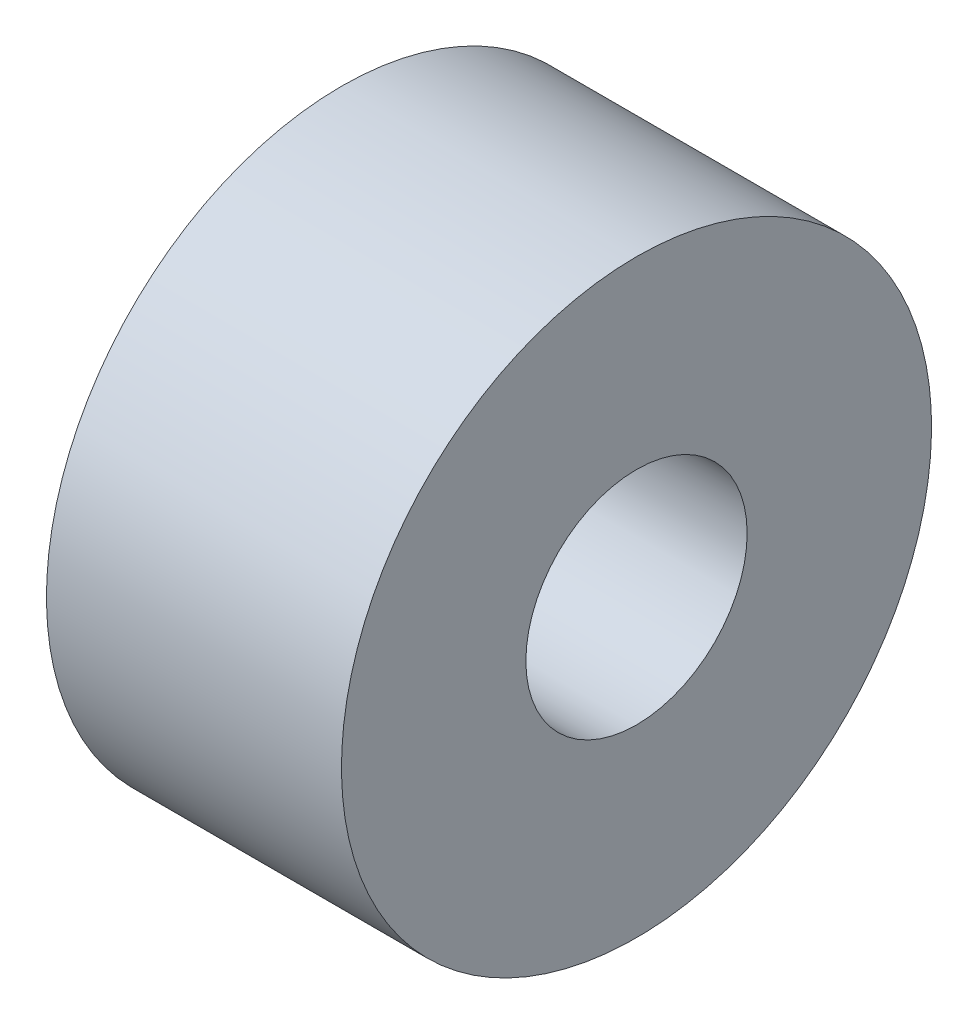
ISO-10303-21;
HEADER;
FILE_DESCRIPTION(('STEP AP214'),'2;1');
FILE_NAME('part.step','',(''),(''),'','','');
FILE_SCHEMA(('AUTOMOTIVE_DESIGN { 1 0 10303 214 1 1 1 1 }'));
ENDSEC;
DATA;
#1=APPLICATION_CONTEXT('core data for automotive mechanical design processes');
#2=APPLICATION_PROTOCOL_DEFINITION('international standard','automotive_design',2000,#1);
#3=PRODUCT_CONTEXT('',#1,'mechanical');
#4=PRODUCT('Part','Part','',(#3));
#5=PRODUCT_RELATED_PRODUCT_CATEGORY('part','',(#4));
#6=PRODUCT_DEFINITION_FORMATION('','',#4);
#7=PRODUCT_DEFINITION_CONTEXT('part definition',#1,'design');
#8=PRODUCT_DEFINITION('design','',#6,#7);
#9=PRODUCT_DEFINITION_SHAPE('','',#8);
#10=(LENGTH_UNIT() NAMED_UNIT(*) SI_UNIT(.MILLI.,.METRE.));
#11=(NAMED_UNIT(*) PLANE_ANGLE_UNIT() SI_UNIT($,.RADIAN.));
#12=(NAMED_UNIT(*) SI_UNIT($,.STERADIAN.) SOLID_ANGLE_UNIT());
#13=UNCERTAINTY_MEASURE_WITH_UNIT(LENGTH_MEASURE(1.E-05),#10,'distance_accuracy_value','');
#14=(GEOMETRIC_REPRESENTATION_CONTEXT(3) GLOBAL_UNCERTAINTY_ASSIGNED_CONTEXT((#13)) GLOBAL_UNIT_ASSIGNED_CONTEXT((#10,
#11,#12)) REPRESENTATION_CONTEXT('',''));
#15=CARTESIAN_POINT('',(0.,0.,0.));
#16=DIRECTION('',(0.,0.,1.));
#17=DIRECTION('',(1.,0.,0.));
#18=AXIS2_PLACEMENT_3D('',#15,#16,#17);
#19=CARTESIAN_POINT('',(13273.7080193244,5713.0723275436,-22.7508621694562));
#20=DIRECTION('',(-0.999999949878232,0.000311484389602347,-5.67539357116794E-05));
#21=DIRECTION('',(-0.000311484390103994,-0.999999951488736,0.));
#22=AXIS2_PLACEMENT_3D('',#19,#20,#21);
#23=CYLINDRICAL_SURFACE('',#22,9.525);
#24=CARTESIAN_POINT('',(13273.7080193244,5713.0723275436,-22.7508621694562));
#25=DIRECTION('',(-0.999999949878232,0.000311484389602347,-5.67539357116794E-05));
#26=DIRECTION('',(-0.000311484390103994,-0.999999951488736,0.));
#27=AXIS2_PLACEMENT_3D('',#24,#25,#26);
#28=CIRCLE('',#27,9.525);
#29=CARTESIAN_POINT('',(13273.7050524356,5703.54732800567,-22.7508621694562));
#30=VERTEX_POINT('',#29);
#31=EDGE_CURVE('E26',#30,#30,#28,.T.);
#32=ORIENTED_EDGE('',*,*,#31,.F.);
#33=EDGE_LOOP('',(#32));
#34=FACE_BOUND('',#33,.T.);
#35=CARTESIAN_POINT('',(13248.3080205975,5713.0802392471,-22.7523037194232));
#36=DIRECTION('',(-0.999999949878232,0.000311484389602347,-5.67539357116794E-05));
#37=DIRECTION('',(-0.000311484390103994,-0.999999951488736,0.));
#38=AXIS2_PLACEMENT_3D('',#35,#36,#37);
#39=CIRCLE('',#38,9.525);
#40=CARTESIAN_POINT('',(13248.3050537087,5703.55523970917,-22.7523037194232));
#41=VERTEX_POINT('',#40);
#42=EDGE_CURVE('E17',#41,#41,#39,.F.);
#43=ORIENTED_EDGE('',*,*,#42,.F.);
#44=EDGE_LOOP('',(#43));
#45=FACE_BOUND('',#44,.T.);
#46=ADVANCED_FACE('F13',(#34,#45),#23,.F.);
#47=CARTESIAN_POINT('',(13248.311869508,5725.69870201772,-21.3155078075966));
#48=DIRECTION('',(-0.999999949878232,0.00031148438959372,-5.67539357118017E-05));
#49=DIRECTION('',(-0.000311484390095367,-0.999999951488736,0.));
#50=AXIS2_PLACEMENT_3D('',#47,#48,#49);
#51=PLANE('',#50);
#52=CARTESIAN_POINT('',(13248.3080205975,5713.0802392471,-22.7523037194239));
#53=DIRECTION('',(0.999999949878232,-0.000311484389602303,5.6753935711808E-05));
#54=DIRECTION('',(0.00031148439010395,0.999999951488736,0.));
#55=AXIS2_PLACEMENT_3D('',#52,#53,#54);
#56=CIRCLE('',#55,25.4000000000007);
#57=CARTESIAN_POINT('',(13248.315932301,5738.48023801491,-22.7523037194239));
#58=VERTEX_POINT('',#57);
#59=EDGE_CURVE('E21',#58,#58,#56,.T.);
#60=ORIENTED_EDGE('',*,*,#59,.F.);
#61=EDGE_LOOP('',(#60));
#62=FACE_BOUND('',#61,.T.);
#63=ORIENTED_EDGE('',*,*,#42,.T.);
#64=EDGE_LOOP('',(#63));
#65=FACE_BOUND('',#64,.T.);
#66=ADVANCED_FACE('F34',(#62,#65),#51,.T.);
#67=CARTESIAN_POINT('',(13273.7118682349,5725.69079031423,-21.3140662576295));
#68=DIRECTION('',(0.999999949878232,-0.00031148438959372,5.67539357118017E-05));
#69=DIRECTION('',(0.000311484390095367,0.999999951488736,0.));
#70=AXIS2_PLACEMENT_3D('',#67,#68,#69);
#71=PLANE('',#70);
#72=CARTESIAN_POINT('',(13273.7080193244,5713.0723275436,-22.7508621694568));
#73=DIRECTION('',(0.999999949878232,-0.000311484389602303,5.6753935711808E-05));
#74=DIRECTION('',(0.00031148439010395,0.999999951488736,0.));
#75=AXIS2_PLACEMENT_3D('',#72,#73,#74);
#76=CIRCLE('',#75,25.4000000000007);
#77=CARTESIAN_POINT('',(13273.7159310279,5738.47232631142,-22.7508621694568));
#78=VERTEX_POINT('',#77);
#79=EDGE_CURVE('E9',#78,#78,#76,.F.);
#80=ORIENTED_EDGE('',*,*,#79,.F.);
#81=EDGE_LOOP('',(#80));
#82=FACE_BOUND('',#81,.T.);
#83=ORIENTED_EDGE('',*,*,#31,.T.);
#84=EDGE_LOOP('',(#83));
#85=FACE_BOUND('',#84,.T.);
#86=ADVANCED_FACE('F43',(#82,#85),#71,.T.);
#87=CARTESIAN_POINT('',(13248.3080205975,5713.0802392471,-22.7523037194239));
#88=DIRECTION('',(0.999999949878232,-0.000311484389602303,5.6753935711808E-05));
#89=DIRECTION('',(0.00031148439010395,0.999999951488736,0.));
#90=AXIS2_PLACEMENT_3D('',#87,#88,#89);
#91=CYLINDRICAL_SURFACE('',#90,25.4000000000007);
#92=ORIENTED_EDGE('',*,*,#59,.T.);
#93=EDGE_LOOP('',(#92));
#94=FACE_BOUND('',#93,.T.);
#95=ORIENTED_EDGE('',*,*,#79,.T.);
#96=EDGE_LOOP('',(#95));
#97=FACE_BOUND('',#96,.T.);
#98=ADVANCED_FACE('F15',(#94,#97),#91,.T.);
#99=CLOSED_SHELL('',(#46,#66,#86,#98));
#100=MANIFOLD_SOLID_BREP('B1',#99);
#101=ADVANCED_BREP_SHAPE_REPRESENTATION('',(#18,#100),#14);
#102=SHAPE_DEFINITION_REPRESENTATION(#9,#101);
ENDSEC;
END-ISO-10303-21;
